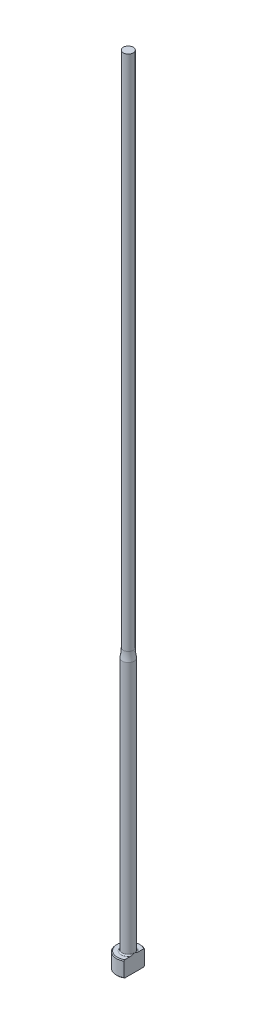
from build123d import *
from build123d.topology import SkipClean

# Parameters (mm, degrees)
CHAMFER1_SIZE    = 0.2
FILLET1_R        = 0.3
KEYED_HEAD_DEPTH = 201.044994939


with BuildPart() as part:
    # Sketch1 → Revolve1 (revolve)
    with BuildSketch(Plane.XY, mode=Mode.PRIVATE) as revolve1_sk:
        with BuildLine():
            Line((0, 0), (-3, 0))
            Line((-3, 0), (-3, 4))
            Line((-3, 4), (-1.5, 4))
            Line((-1.5, 4), (-1.5, 67.777951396))
            ThreePointArc((-1.5, 67.777951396), (-1.312696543, 68.881966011), (-1.25, 70))
            Line((-1.25, 70), (-1.25, 200))
            Line((-1.25, 200), (0, 200))
            Line((0, 200), (0, 0))
        make_face()
    revolve(revolve1_sk.sketch.rotate(Axis((0, 259.958771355, 0), (0, -1, 0)), 270), axis=Axis((0, 259.958771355, 0), (0, -1, 0)))

    # Chamfer1
    chamfer1_edges = [part.edges().sort_by_distance(p)[0] for p in [
        (0, 0, -3),
        (0, 4, -3),
    ]]
    chamfer(chamfer1_edges, length=CHAMFER1_SIZE)

    # Fillet1
    fillet1_edges = [part.edges().sort_by_distance(p)[0] for p in [
        (0, 4, -1.5),
    ]]
    fillet(fillet1_edges, radius=FILLET1_R)

    # Sketch2 → Keyed Head (cut, through all)
    with SkipClean():  # the faces are left unmerged after this step: merging them gives an invalid solid
        with BuildSketch(Plane(origin=(0, 0, 0), x_dir=(1, 0, 0), z_dir=(0, 1, 0))):
            with BuildLine():
                Line((1.5, -2.598076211), (1.5, 2.598076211))
                ThreePointArc((1.5, 2.598076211), (3, 0), (1.5, -2.598076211))
            make_face()
        extrude(amount=KEYED_HEAD_DEPTH, mode=Mode.SUBTRACT)


solid = part.part
